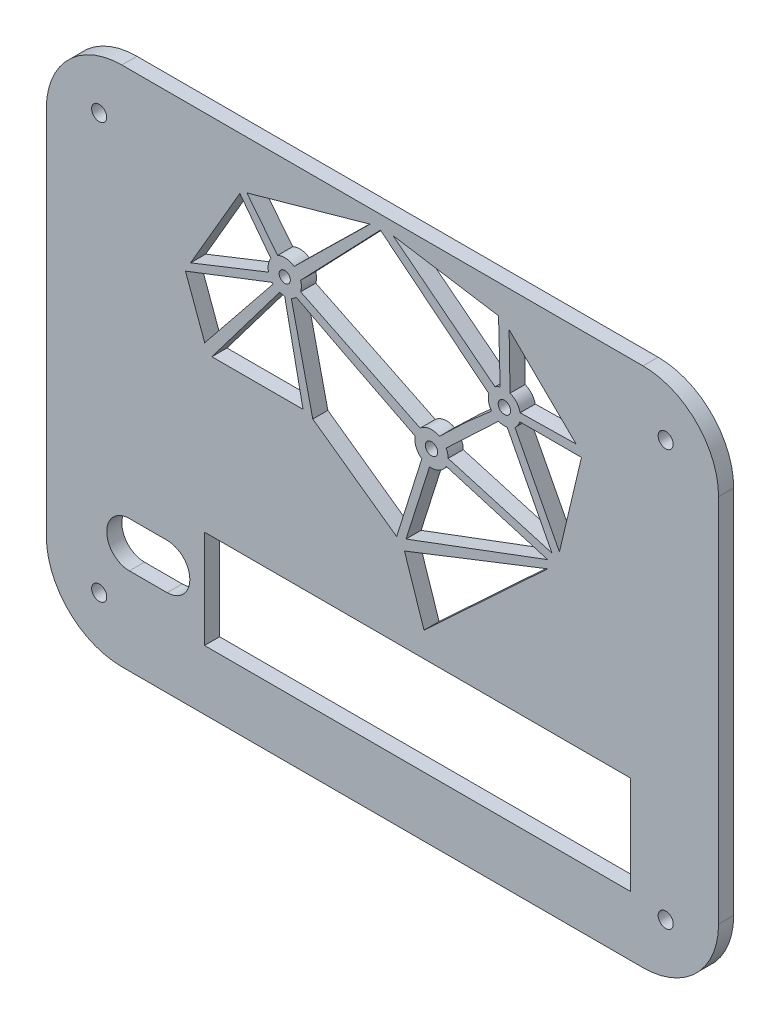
from build123d import *

# Parameters (mm, degrees)
SKETCH_1_R          = 1
EXTRUDE_1_DEPTH     = 2
CUT_EXTRUDE_1_REACH = 114.632
CUT_EXTRUDE_2_REACH = 114.632
SKETCH_3_W          = 56.426209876
SKETCH_3_H          = 13
CUT_EXTRUDE_3_REACH = 114.632
SKETCH_4_R          = 0.740461
SKETCH_4_R_2        = 0.813320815
SKETCH_4_R_3        = 0.820057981


with BuildPart() as part:
    # Sketch 1 → Extrude 1 (new body)
    # profile 1 of 8: a face of its own
    with BuildSketch(Plane.XY):
        Polygon((44.5, 0), (10, 0), (10, -10), (0, -10), (0, -34.5), (44.5, -34.5), align=None)
    # profile 2 of 8: a face of its own
    with BuildSketch(Plane.XY):
        Polygon((79, 0), (44.5, 0), (44.5, -34.5), (89, -34.5), (89, -10), (79, -10), align=None)
    # profile 3 of 8: a face of its own
    with BuildSketch(Plane.XY):
        Polygon((44.5, -69), (44.5, -34.5), (0, -34.5), (0, -59), (10, -59), (10, -69), align=None)
    # profile 4 of 8: a face of its own
    with BuildSketch(Plane.XY):
        Polygon((89, -34.5), (44.5, -34.5), (44.5, -69), (79, -69), (79, -59), (89, -59), align=None)
    # profile 5 of 8: a face of its own
    with BuildSketch(Plane.XY):
        with BuildLine():
            Line((10, 0), (10, -10))
            Line((10, -10), (0, -10))
            ThreePointArc((0, -10), (2.928932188, -2.928932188), (10, 0))
        make_face()
        with Locations((7, -7)):
            Circle(SKETCH_1_R, mode=Mode.SUBTRACT)
    # profile 6 of 8: a face of its own
    with BuildSketch(Plane.XY):
        with BuildLine():
            ThreePointArc((79, 0), (86.071067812, -2.928932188), (89, -10))
            Line((89, -10), (79, -10))
            Line((79, -10), (79, 0))
        make_face()
        with Locations((82, -7)):
            Circle(SKETCH_1_R, mode=Mode.SUBTRACT)
    # profile 7 of 8: a face of its own
    with BuildSketch(Plane.XY):
        with BuildLine():
            Line((10, -59), (0, -59))
            ThreePointArc((0, -59), (2.928932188, -66.071067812), (10, -69))
            Line((10, -69), (10, -59))
        make_face()
        with Locations((7, -62)):
            Circle(SKETCH_1_R, mode=Mode.SUBTRACT)
    # profile 8 of 8: a face of its own
    with BuildSketch(Plane.XY):
        with BuildLine():
            Line((79, -69), (79, -59))
            Line((79, -59), (89, -59))
            ThreePointArc((89, -59), (86.071067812, -66.071067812), (79, -69))
        make_face()
        with Locations((82, -62)):
            Circle(SKETCH_1_R, mode=Mode.SUBTRACT)
    extrude(amount=-EXTRUDE_1_DEPTH)

    # Sketch 2 → Cut-Extrude 1 (cut, up to next)
    with BuildSketch(Plane.XY, mode=Mode.PRIVATE) as cut_extrude_1_sk1:
        with BuildLine():
            Line((11, -51.5), (16, -51.5))
            ThreePointArc((16, -51.5), (19, -54.5), (16, -57.5))
            Line((16, -57.5), (11, -57.5))
            ThreePointArc((11, -57.5), (8, -54.5), (11, -51.5))
        make_face()
    cut_extrude_1_tool1 = extrude(cut_extrude_1_sk1.sketch, amount=-CUT_EXTRUDE_1_REACH, mode=Mode.PRIVATE) & part.part
    add(cut_extrude_1_tool1.solids().sort_by_distance((13.5, -54.5, 0))[0], mode=Mode.SUBTRACT)

    # Sketch 3 → Cut-Extrude 2 (cut, up to next)
    with BuildSketch(Plane.XY, mode=Mode.PRIVATE) as cut_extrude_2_sk1:
        with Locations((49.151392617, -54.584348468)):
            Rectangle(SKETCH_3_W, SKETCH_3_H)
    cut_extrude_2_tool1 = extrude(cut_extrude_2_sk1.sketch, amount=-CUT_EXTRUDE_2_REACH, mode=Mode.PRIVATE) & part.part
    add(cut_extrude_2_tool1.solids().sort_by_distance((49.151393, -54.584348, 0))[0], mode=Mode.SUBTRACT)

    # Sketch 4 → Cut-Extrude 3 (cut, up to next)
    with BuildSketch(Plane.XY, mode=Mode.PRIVATE) as cut_extrude_3_sk1:
        with BuildLine():
            Line((26.551833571, -6.38746953), (30.617859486, -11.518503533))
            ThreePointArc((30.617859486, -11.518503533), (31.736947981, -11.310402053), (32.810649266, -11.688331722))
            Line((32.810649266, -11.688331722), (42.857597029, -1.819271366))
            Line((42.857597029, -1.819271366), (26.551833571, -6.38746953))
        make_face()
    cut_extrude_3_tool1 = extrude(cut_extrude_3_sk1.sketch, amount=-CUT_EXTRUDE_3_REACH, mode=Mode.PRIVATE) & part.part
    # Sketch 4 → Cut-Extrude 3 (cut, up to next)
    with BuildSketch(Plane.XY, mode=Mode.PRIVATE) as cut_extrude_3_sk2:
        with BuildLine():
            Line((29.71966231, -12.305090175), (25.624356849, -6.911105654))
            Line((25.624356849, -6.911105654), (19.101020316, -18.131976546))
            Line((19.101020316, -18.131976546), (29.427775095, -14.04090443))
            ThreePointArc((29.427775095, -14.04090443), (29.392941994, -13.142598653), (29.71966231, -12.305090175))
        make_face()
    cut_extrude_3_tool2 = extrude(cut_extrude_3_sk2.sketch, amount=-CUT_EXTRUDE_3_REACH, mode=Mode.PRIVATE) & part.part
    # Sketch 4 → Cut-Extrude 3 (cut, up to next)
    with BuildSketch(Plane.XY, mode=Mode.PRIVATE) as cut_extrude_3_sk3:
        with BuildLine():
            ThreePointArc((30.032334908, -15.090731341), (29.972405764, -15.030340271), (29.914851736, -14.967681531))
            Line((29.914851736, -14.967681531), (18.421083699, -19.418282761))
            Line((18.421083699, -19.418282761), (20.971275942, -26.365204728))
            Line((20.971275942, -26.365204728), (30.032334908, -15.090731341))
        make_face()
    cut_extrude_3_tool3 = extrude(cut_extrude_3_sk3.sketch, amount=-CUT_EXTRUDE_3_REACH, mode=Mode.PRIVATE) & part.part
    # Sketch 4 → Cut-Extrude 3 (cut, up to next)
    with BuildSketch(Plane.XY, mode=Mode.PRIVATE) as cut_extrude_3_sk4:
        with BuildLine():
            ThreePointArc((31.554094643, -15.712412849), (31.220078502, -15.685020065), (30.894075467, -15.607307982))
            Line((30.894075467, -15.607307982), (21.91981842, -27.487784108))
            Line((21.91981842, -27.487784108), (33.987562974, -27.487784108))
            Line((33.987562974, -27.487784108), (31.554094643, -15.712412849))
        make_face()
    cut_extrude_3_tool4 = extrude(cut_extrude_3_sk4.sketch, amount=-CUT_EXTRUDE_3_REACH, mode=Mode.PRIVATE) & part.part
    # Sketch 4 → Cut-Extrude 3 (cut, up to next)
    with BuildSketch(Plane.XY, mode=Mode.PRIVATE) as cut_extrude_3_sk5:
        with BuildLine():
            Line((39.670415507, -18.489723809), (33.101139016, -15.090731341))
            ThreePointArc((33.101139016, -15.090731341), (32.788510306, -15.342874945), (32.435320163, -15.534107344))
            Line((32.435320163, -15.534107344), (35.273577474, -27.953433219))
            Line((35.273577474, -27.953433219), (46.381058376, -35.875964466))
            Line((46.381058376, -35.875964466), (49.71272558, -25.296027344))
            ThreePointArc((49.71272558, -25.296027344), (48.953979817, -24.33842803), (48.821972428, -23.123822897))
            Line((48.821972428, -23.123822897), (39.670415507, -18.489723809))
        make_face()
    cut_extrude_3_tool5 = extrude(cut_extrude_3_sk5.sketch, amount=-CUT_EXTRUDE_3_REACH, mode=Mode.PRIVATE) & part.part
    # Sketch 4 → Cut-Extrude 3 (cut, up to next)
    with BuildSketch(Plane.XY, mode=Mode.PRIVATE) as cut_extrude_3_sk6:
        with BuildLine():
            Line((44.225353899, -1.819271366), (33.668211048, -12.842696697))
            ThreePointArc((33.668211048, -12.842696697), (33.745189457, -13.171465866), (33.771051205, -13.50813486))
            ThreePointArc((33.771051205, -13.50813486), (33.745189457, -13.844803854), (33.668211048, -14.173573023))
            Line((33.668211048, -14.173573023), (49.492109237, -21.888754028))
            ThreePointArc((49.492109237, -21.888754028), (50.711573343, -21.316782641), (52.036115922, -21.561386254))
            Line((52.036115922, -21.561386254), (55.490802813, -18.236876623))
            Line((55.490802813, -18.236876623), (58.941354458, -15.204854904))
            ThreePointArc((58.941354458, -15.204854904), (58.555360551, -14.33538652), (58.58699022, -13.384615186))
            Line((58.58699022, -13.384615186), (44.225353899, -1.819271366))
        make_face()
    cut_extrude_3_tool6 = extrude(cut_extrude_3_sk6.sketch, amount=-CUT_EXTRUDE_3_REACH, mode=Mode.PRIVATE) & part.part
    # Sketch 4 → Cut-Extrude 3 (cut, up to next)
    with BuildSketch(Plane.XY, mode=Mode.PRIVATE) as cut_extrude_3_sk7:
        with BuildLine():
            Line((45.888987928, -1.608866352), (59.403976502, -12.200184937))
            ThreePointArc((59.403976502, -12.200184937), (59.729360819, -12.008222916), (60.083573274, -11.876853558))
            Line((60.083573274, -11.876853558), (59.870610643, -3.82441582))
            Line((59.870610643, -3.82441582), (45.888987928, -1.608866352))
        make_face()
    cut_extrude_3_tool7 = extrude(cut_extrude_3_sk7.sketch, amount=-CUT_EXTRUDE_3_REACH, mode=Mode.PRIVATE) & part.part
    # Sketch 4 → Cut-Extrude 3 (cut, up to next)
    with BuildSketch(Plane.XY, mode=Mode.PRIVATE) as cut_extrude_3_sk8:
        with BuildLine():
            ThreePointArc((62.671923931, -14.567955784), (62.422172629, -15.094839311), (62.038733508, -15.534107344))
            Line((62.038733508, -15.534107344), (67.93091315, -26.870821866))
            Line((67.93091315, -26.870821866), (70.848713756, -14.567955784))
            Line((70.848713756, -14.567955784), (62.671923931, -14.567955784))
        make_face()
    cut_extrude_3_tool8 = extrude(cut_extrude_3_sk8.sketch, amount=-CUT_EXTRUDE_3_REACH, mode=Mode.PRIVATE) & part.part
    # Sketch 4 → Cut-Extrude 3 (cut, up to next)
    with BuildSketch(Plane.XY, mode=Mode.PRIVATE) as cut_extrude_3_sk9:
        with BuildLine():
            Line((61.270019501, -4.698540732), (61.390679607, -11.937596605))
            ThreePointArc((61.390679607, -11.937596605), (62.262550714, -12.549874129), (62.728146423, -13.50813486))
            Line((62.728146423, -13.50813486), (70.138763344, -13.384615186))
            Line((70.138763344, -13.384615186), (61.270019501, -4.698540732))
        make_face()
    cut_extrude_3_tool9 = extrude(cut_extrude_3_sk9.sketch, amount=-CUT_EXTRUDE_3_REACH, mode=Mode.PRIVATE) & part.part
    # Sketch 4 → Cut-Extrude 3 (cut, up to next)
    with BuildSketch(Plane.XY, mode=Mode.PRIVATE) as cut_extrude_3_sk10:
        with BuildLine():
            ThreePointArc((61.014395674, -16.023297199), (60.434752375, -16.045705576), (59.870610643, -15.91067745))
            Line((59.870610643, -15.91067745), (52.932925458, -22.457448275))
            ThreePointArc((52.932925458, -22.457448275), (53.129531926, -22.96355083), (53.196421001, -23.50236411))
            Line((53.196421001, -23.50236411), (66.944484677, -27.487784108))
            Line((66.944484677, -27.487784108), (61.014395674, -16.023297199))
        make_face()
    cut_extrude_3_tool10 = extrude(cut_extrude_3_sk10.sketch, amount=-CUT_EXTRUDE_3_REACH, mode=Mode.PRIVATE) & part.part
    # Sketch 4 → Cut-Extrude 3 (cut, up to next)
    with BuildSketch(Plane.XY, mode=Mode.PRIVATE) as cut_extrude_3_sk11:
        with BuildLine():
            ThreePointArc((52.932925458, -24.547279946), (52.0105537, -25.456866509), (50.736467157, -25.691005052))
            Line((50.736467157, -25.691005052), (47.619493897, -35.541205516))
            Line((47.619493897, -35.541205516), (66.381949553, -28.52489892))
            Line((66.381949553, -28.52489892), (52.932925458, -24.547279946))
        make_face()
    cut_extrude_3_tool11 = extrude(cut_extrude_3_sk11.sketch, amount=-CUT_EXTRUDE_3_REACH, mode=Mode.PRIVATE) & part.part
    # Sketch 4 → Cut-Extrude 3 (cut, up to next)
    with BuildSketch(Plane.XY, mode=Mode.PRIVATE) as cut_extrude_3_sk12:
        Polygon((50.002721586, -44.796327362), (47.414429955, -37.012816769), (66.381949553, -29.57390315), align=None)
    cut_extrude_3_tool12 = extrude(cut_extrude_3_sk12.sketch, amount=-CUT_EXTRUDE_3_REACH, mode=Mode.PRIVATE) & part.part
    # Sketch 4 → Cut-Extrude 3 (cut, up to next)
    with BuildSketch(Plane.XY, mode=Mode.PRIVATE) as cut_extrude_3_sk13:
        with Locations((31.566736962, -13.50813486)):
            Circle(SKETCH_4_R)
    cut_extrude_3_tool13 = extrude(cut_extrude_3_sk13.sketch, amount=-CUT_EXTRUDE_3_REACH, mode=Mode.PRIVATE) & part.part
    # Sketch 4 → Cut-Extrude 3 (cut, up to next)
    with BuildSketch(Plane.XY, mode=Mode.PRIVATE) as cut_extrude_3_sk14:
        with Locations((50.992818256, -23.50236411)):
            Circle(SKETCH_4_R_2)
    cut_extrude_3_tool14 = extrude(cut_extrude_3_sk14.sketch, amount=-CUT_EXTRUDE_3_REACH, mode=Mode.PRIVATE) & part.part
    # Sketch 4 → Cut-Extrude 3 (cut, up to next)
    with BuildSketch(Plane.XY, mode=Mode.PRIVATE) as cut_extrude_3_sk15:
        with Locations((60.643174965, -13.928930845)):
            Circle(SKETCH_4_R_3)
    cut_extrude_3_tool15 = extrude(cut_extrude_3_sk15.sketch, amount=-CUT_EXTRUDE_3_REACH, mode=Mode.PRIVATE) & part.part
    add(cut_extrude_3_tool1.solids().sort_by_distance((33.74434, -6.871453, 0))[0], mode=Mode.SUBTRACT)
    add(cut_extrude_3_tool2.solids().sort_by_distance((25.011842, -12.854316, 0))[0], mode=Mode.SUBTRACT)
    add(cut_extrude_3_tool3.solids().sort_by_distance((23.203214, -20.212828, 0))[0], mode=Mode.SUBTRACT)
    add(cut_extrude_3_tool4.solids().sort_by_distance((29.093471, -23.333256, 0))[0], mode=Mode.SUBTRACT)
    add(cut_extrude_3_tool5.solids().sort_by_distance((41.234753, -25.276038, 0))[0], mode=Mode.SUBTRACT)
    add(cut_extrude_3_tool6.solids().sort_by_distance((46.461025, -12.730661, 0))[0], mode=Mode.SUBTRACT)
    add(cut_extrude_3_tool7.solids().sort_by_distance((55.26529, -6.029531, 0))[0], mode=Mode.SUBTRACT)
    add(cut_extrude_3_tool8.solids().sort_by_distance((66.82224, -18.709407, 0))[0], mode=Mode.SUBTRACT)
    add(cut_extrude_3_tool9.solids().sort_by_distance((64.36509, -10.447465, 0))[0], mode=Mode.SUBTRACT)
    add(cut_extrude_3_tool10.solids().sort_by_distance((59.945552, -22.002112, 0))[0], mode=Mode.SUBTRACT)
    add(cut_extrude_3_tool11.solids().sort_by_distance((55.1633, -29.475435, 0))[0], mode=Mode.SUBTRACT)
    add(cut_extrude_3_tool12.solids().sort_by_distance((54.5997, -37.127682, 0))[0], mode=Mode.SUBTRACT)
    add(cut_extrude_3_tool13.solids().sort_by_distance((31.566737, -13.508135, 0))[0], mode=Mode.SUBTRACT)
    add(cut_extrude_3_tool14.solids().sort_by_distance((50.992818, -23.502364, 0))[0], mode=Mode.SUBTRACT)
    add(cut_extrude_3_tool15.solids().sort_by_distance((60.643175, -13.928931, 0))[0], mode=Mode.SUBTRACT)


solid = part.part
